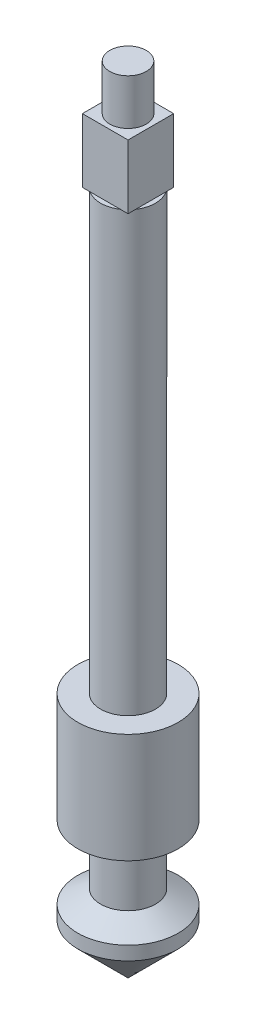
ISO-10303-21;
HEADER;
FILE_DESCRIPTION(('STEP AP214'),'2;1');
FILE_NAME('part.step','',(''),(''),'','','');
FILE_SCHEMA(('AUTOMOTIVE_DESIGN { 1 0 10303 214 1 1 1 1 }'));
ENDSEC;
DATA;
#1=APPLICATION_CONTEXT('core data for automotive mechanical design processes');
#2=APPLICATION_PROTOCOL_DEFINITION('international standard','automotive_design',2000,#1);
#3=PRODUCT_CONTEXT('',#1,'mechanical');
#4=PRODUCT('Part','Part','',(#3));
#5=PRODUCT_RELATED_PRODUCT_CATEGORY('part','',(#4));
#6=PRODUCT_DEFINITION_FORMATION('','',#4);
#7=PRODUCT_DEFINITION_CONTEXT('part definition',#1,'design');
#8=PRODUCT_DEFINITION('design','',#6,#7);
#9=PRODUCT_DEFINITION_SHAPE('','',#8);
#10=(LENGTH_UNIT() NAMED_UNIT(*) SI_UNIT(.MILLI.,.METRE.));
#11=(NAMED_UNIT(*) PLANE_ANGLE_UNIT() SI_UNIT($,.RADIAN.));
#12=(NAMED_UNIT(*) SI_UNIT($,.STERADIAN.) SOLID_ANGLE_UNIT());
#13=UNCERTAINTY_MEASURE_WITH_UNIT(LENGTH_MEASURE(1.E-05),#10,'distance_accuracy_value','');
#14=(GEOMETRIC_REPRESENTATION_CONTEXT(3) GLOBAL_UNCERTAINTY_ASSIGNED_CONTEXT((#13)) GLOBAL_UNIT_ASSIGNED_CONTEXT((#10,
#11,#12)) REPRESENTATION_CONTEXT('',''));
#15=CARTESIAN_POINT('',(0.,0.,0.));
#16=DIRECTION('',(0.,0.,1.));
#17=DIRECTION('',(1.,0.,0.));
#18=AXIS2_PLACEMENT_3D('',#15,#16,#17);
#19=CARTESIAN_POINT('',(0.,11.0000000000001,0.));
#20=DIRECTION('',(0.,1.,0.));
#21=DIRECTION('',(0.,0.,1.));
#22=AXIS2_PLACEMENT_3D('',#19,#20,#21);
#23=CONICAL_SURFACE('',#22,11.0000000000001,0.785398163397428);
#24=CARTESIAN_POINT('',(0.,0.,0.));
#25=VERTEX_POINT('',#24);
#26=VERTEX_LOOP('',#25);
#27=FACE_BOUND('',#26,.T.);
#28=CARTESIAN_POINT('',(0.,11.,0.));
#29=DIRECTION('',(0.,-1.,0.));
#30=DIRECTION('',(0.,0.,-1.));
#31=AXIS2_PLACEMENT_3D('',#28,#29,#30);
#32=CIRCLE('',#31,11.);
#33=CARTESIAN_POINT('',(0.,11.,-11.));
#34=VERTEX_POINT('',#33);
#35=EDGE_CURVE('E136',#34,#34,#32,.F.);
#36=ORIENTED_EDGE('',*,*,#35,.F.);
#37=EDGE_LOOP('',(#36));
#38=FACE_BOUND('',#37,.T.);
#39=ADVANCED_FACE('F16',(#27,#38),#23,.T.);
#40=CARTESIAN_POINT('',(0.,0.,0.));
#41=DIRECTION('',(0.,-1.,0.));
#42=DIRECTION('',(0.,0.,-1.));
#43=AXIS2_PLACEMENT_3D('',#40,#41,#42);
#44=CYLINDRICAL_SURFACE('',#43,11.);
#45=CARTESIAN_POINT('',(0.,14.,0.));
#46=DIRECTION('',(0.,-1.,0.));
#47=DIRECTION('',(0.,0.,-1.));
#48=AXIS2_PLACEMENT_3D('',#45,#46,#47);
#49=CIRCLE('',#48,11.);
#50=CARTESIAN_POINT('',(0.,14.,-11.));
#51=VERTEX_POINT('',#50);
#52=EDGE_CURVE('E133',#51,#51,#49,.F.);
#53=ORIENTED_EDGE('',*,*,#52,.F.);
#54=EDGE_LOOP('',(#53));
#55=FACE_BOUND('',#54,.T.);
#56=ORIENTED_EDGE('',*,*,#35,.T.);
#57=EDGE_LOOP('',(#56));
#58=FACE_BOUND('',#57,.T.);
#59=ADVANCED_FACE('F192',(#55,#58),#44,.T.);
#60=CARTESIAN_POINT('',(0.,14.,0.));
#61=DIRECTION('',(0.,-1.,0.));
#62=DIRECTION('',(1.,0.,0.));
#63=AXIS2_PLACEMENT_3D('',#60,#61,#62);
#64=CONICAL_SURFACE('',#63,11.,1.03037682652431);
#65=CARTESIAN_POINT('',(0.,17.,0.));
#66=DIRECTION('',(0.,-1.,0.));
#67=DIRECTION('',(0.,0.,-1.));
#68=AXIS2_PLACEMENT_3D('',#65,#66,#67);
#69=CIRCLE('',#68,6.);
#70=CARTESIAN_POINT('',(0.,17.,-6.));
#71=VERTEX_POINT('',#70);
#72=EDGE_CURVE('E130',#71,#71,#69,.F.);
#73=ORIENTED_EDGE('',*,*,#72,.F.);
#74=EDGE_LOOP('',(#73));
#75=FACE_BOUND('',#74,.T.);
#76=ORIENTED_EDGE('',*,*,#52,.T.);
#77=EDGE_LOOP('',(#76));
#78=FACE_BOUND('',#77,.T.);
#79=ADVANCED_FACE('F183',(#75,#78),#64,.T.);
#80=CARTESIAN_POINT('',(0.,174.,0.));
#81=DIRECTION('',(0.,1.,0.));
#82=DIRECTION('',(0.,0.,1.));
#83=AXIS2_PLACEMENT_3D('',#80,#81,#82);
#84=PLANE('',#83);
#85=CARTESIAN_POINT('',(0.,174.,0.));
#86=DIRECTION('',(0.,-1.,0.));
#87=DIRECTION('',(0.,0.,-1.));
#88=AXIS2_PLACEMENT_3D('',#85,#86,#87);
#89=CIRCLE('',#88,4.);
#90=CARTESIAN_POINT('',(0.,174.,-4.));
#91=VERTEX_POINT('',#90);
#92=EDGE_CURVE('E19',#91,#91,#89,.T.);
#93=ORIENTED_EDGE('',*,*,#92,.F.);
#94=EDGE_LOOP('',(#93));
#95=FACE_BOUND('',#94,.T.);
#96=ADVANCED_FACE('F180',(#95),#84,.T.);
#97=CARTESIAN_POINT('',(0.,0.,0.));
#98=DIRECTION('',(0.,-1.,0.));
#99=DIRECTION('',(0.,0.,-1.));
#100=AXIS2_PLACEMENT_3D('',#97,#98,#99);
#101=CYLINDRICAL_SURFACE('',#100,6.);
#102=CARTESIAN_POINT('',(0.,30.,0.));
#103=DIRECTION('',(0.,-1.,0.));
#104=DIRECTION('',(0.,0.,-1.));
#105=AXIS2_PLACEMENT_3D('',#102,#103,#104);
#106=CIRCLE('',#105,6.);
#107=CARTESIAN_POINT('',(0.,30.,-6.));
#108=VERTEX_POINT('',#107);
#109=EDGE_CURVE('E171',#108,#108,#106,.F.);
#110=ORIENTED_EDGE('',*,*,#109,.F.);
#111=EDGE_LOOP('',(#110));
#112=FACE_BOUND('',#111,.T.);
#113=ORIENTED_EDGE('',*,*,#72,.T.);
#114=EDGE_LOOP('',(#113));
#115=FACE_BOUND('',#114,.T.);
#116=ADVANCED_FACE('F182',(#112,#115),#101,.T.);
#117=CARTESIAN_POINT('',(0.,174.,0.));
#118=DIRECTION('',(0.,-1.,0.));
#119=DIRECTION('',(0.,0.,-1.));
#120=AXIS2_PLACEMENT_3D('',#117,#118,#119);
#121=CYLINDRICAL_SURFACE('',#120,4.);
#122=CARTESIAN_POINT('',(0.,164.,0.));
#123=DIRECTION('',(0.,-1.,0.));
#124=DIRECTION('',(0.,0.,-1.));
#125=AXIS2_PLACEMENT_3D('',#122,#123,#124);
#126=CIRCLE('',#125,4.);
#127=CARTESIAN_POINT('',(0.,164.,-4.));
#128=VERTEX_POINT('',#127);
#129=EDGE_CURVE('E100',#128,#128,#126,.T.);
#130=ORIENTED_EDGE('',*,*,#129,.F.);
#131=EDGE_LOOP('',(#130));
#132=FACE_BOUND('',#131,.T.);
#133=ORIENTED_EDGE('',*,*,#92,.T.);
#134=EDGE_LOOP('',(#133));
#135=FACE_BOUND('',#134,.T.);
#136=ADVANCED_FACE('F178',(#132,#135),#121,.T.);
#137=CARTESIAN_POINT('',(6.,30.,0.));
#138=DIRECTION('',(0.,-1.,0.));
#139=DIRECTION('',(0.,0.,-1.));
#140=AXIS2_PLACEMENT_3D('',#137,#138,#139);
#141=PLANE('',#140);
#142=ORIENTED_EDGE('',*,*,#109,.T.);
#143=EDGE_LOOP('',(#142));
#144=FACE_BOUND('',#143,.T.);
#145=CARTESIAN_POINT('',(0.,30.,0.));
#146=DIRECTION('',(0.,-1.,0.));
#147=DIRECTION('',(0.,0.,-1.));
#148=AXIS2_PLACEMENT_3D('',#145,#146,#147);
#149=CIRCLE('',#148,11.);
#150=CARTESIAN_POINT('',(0.,30.,-11.));
#151=VERTEX_POINT('',#150);
#152=EDGE_CURVE('E165',#151,#151,#149,.F.);
#153=ORIENTED_EDGE('',*,*,#152,.F.);
#154=EDGE_LOOP('',(#153));
#155=FACE_BOUND('',#154,.T.);
#156=ADVANCED_FACE('F255',(#144,#155),#141,.T.);
#157=CARTESIAN_POINT('',(-5.,164.,-5.));
#158=DIRECTION('',(1.,0.,0.));
#159=DIRECTION('',(0.,0.,-1.));
#160=AXIS2_PLACEMENT_3D('',#157,#158,#159);
#161=PLANE('',#160);
#162=DIRECTION('',(0.,0.,1.));
#163=VECTOR('',#162,1.);
#164=CARTESIAN_POINT('',(-5.,150.,0.));
#165=LINE('',#164,#163);
#166=CARTESIAN_POINT('',(-5.,150.,3.31662479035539));
#167=VERTEX_POINT('',#166);
#168=CARTESIAN_POINT('',(-5.,150.,-3.3166247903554));
#169=VERTEX_POINT('',#168);
#170=EDGE_CURVE('E58',#167,#169,#165,.F.);
#171=ORIENTED_EDGE('',*,*,#170,.F.);
#172=DIRECTION('',(0.,0.,1.));
#173=VECTOR('',#172,1.);
#174=CARTESIAN_POINT('',(-5.,150.,0.));
#175=LINE('',#174,#173);
#176=CARTESIAN_POINT('',(-5.,150.,5.));
#177=VERTEX_POINT('',#176);
#178=EDGE_CURVE('E168',#167,#177,#175,.T.);
#179=ORIENTED_EDGE('',*,*,#178,.T.);
#180=DIRECTION('',(0.,1.,0.));
#181=VECTOR('',#180,1.);
#182=CARTESIAN_POINT('',(-5.,164.,5.));
#183=LINE('',#182,#181);
#184=CARTESIAN_POINT('',(-5.,164.,5.));
#185=VERTEX_POINT('',#184);
#186=EDGE_CURVE('E98',#177,#185,#183,.T.);
#187=ORIENTED_EDGE('',*,*,#186,.T.);
#188=DIRECTION('',(0.,0.,1.));
#189=VECTOR('',#188,1.);
#190=CARTESIAN_POINT('',(-5.,164.,0.));
#191=LINE('',#190,#189);
#192=CARTESIAN_POINT('',(-5.,164.,-5.));
#193=VERTEX_POINT('',#192);
#194=EDGE_CURVE('E92',#193,#185,#191,.T.);
#195=ORIENTED_EDGE('',*,*,#194,.F.);
#196=DIRECTION('',(0.,1.,0.));
#197=VECTOR('',#196,1.);
#198=CARTESIAN_POINT('',(-5.,164.,-5.));
#199=LINE('',#198,#197);
#200=CARTESIAN_POINT('',(-5.,150.,-5.));
#201=VERTEX_POINT('',#200);
#202=EDGE_CURVE('E95',#193,#201,#199,.F.);
#203=ORIENTED_EDGE('',*,*,#202,.T.);
#204=DIRECTION('',(0.,0.,1.));
#205=VECTOR('',#204,1.);
#206=CARTESIAN_POINT('',(-5.,150.,0.));
#207=LINE('',#206,#205);
#208=EDGE_CURVE('E108',#201,#169,#207,.T.);
#209=ORIENTED_EDGE('',*,*,#208,.T.);
#210=EDGE_LOOP('',(#171,#179,#187,#195,#203,#209));
#211=FACE_BOUND('',#210,.T.);
#212=ADVANCED_FACE('F93',(#211),#161,.F.);
#213=CARTESIAN_POINT('',(0.,164.,0.));
#214=DIRECTION('',(0.,1.,0.));
#215=DIRECTION('',(0.,0.,1.));
#216=AXIS2_PLACEMENT_3D('',#213,#214,#215);
#217=PLANE('',#216);
#218=ORIENTED_EDGE('',*,*,#194,.T.);
#219=DIRECTION('',(-1.,0.,0.));
#220=VECTOR('',#219,1.);
#221=CARTESIAN_POINT('',(-5.,164.,5.));
#222=LINE('',#221,#220);
#223=CARTESIAN_POINT('',(5.,164.,5.));
#224=VERTEX_POINT('',#223);
#225=EDGE_CURVE('E127',#185,#224,#222,.F.);
#226=ORIENTED_EDGE('',*,*,#225,.T.);
#227=DIRECTION('',(0.,0.,1.));
#228=VECTOR('',#227,1.);
#229=CARTESIAN_POINT('',(5.,164.,5.));
#230=LINE('',#229,#228);
#231=CARTESIAN_POINT('',(5.,164.,-5.));
#232=VERTEX_POINT('',#231);
#233=EDGE_CURVE('E74',#224,#232,#230,.F.);
#234=ORIENTED_EDGE('',*,*,#233,.T.);
#235=DIRECTION('',(1.,0.,0.));
#236=VECTOR('',#235,1.);
#237=CARTESIAN_POINT('',(5.,164.,-5.));
#238=LINE('',#237,#236);
#239=EDGE_CURVE('E102',#232,#193,#238,.F.);
#240=ORIENTED_EDGE('',*,*,#239,.T.);
#241=EDGE_LOOP('',(#218,#226,#234,#240));
#242=FACE_BOUND('',#241,.T.);
#243=ORIENTED_EDGE('',*,*,#129,.T.);
#244=EDGE_LOOP('',(#243));
#245=FACE_BOUND('',#244,.T.);
#246=ADVANCED_FACE('F103',(#242,#245),#217,.T.);
#247=CARTESIAN_POINT('',(-5.,164.,5.));
#248=DIRECTION('',(0.,0.,-1.));
#249=DIRECTION('',(-1.,0.,0.));
#250=AXIS2_PLACEMENT_3D('',#247,#248,#249);
#251=PLANE('',#250);
#252=DIRECTION('',(1.,0.,0.));
#253=VECTOR('',#252,1.);
#254=CARTESIAN_POINT('',(0.,150.,5.));
#255=LINE('',#254,#253);
#256=CARTESIAN_POINT('',(3.3166247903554,150.,5.));
#257=VERTEX_POINT('',#256);
#258=CARTESIAN_POINT('',(-3.3166247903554,150.,5.));
#259=VERTEX_POINT('',#258);
#260=EDGE_CURVE('E164',#257,#259,#255,.F.);
#261=ORIENTED_EDGE('',*,*,#260,.F.);
#262=DIRECTION('',(-1.,0.,0.));
#263=VECTOR('',#262,1.);
#264=CARTESIAN_POINT('',(-5.,150.,5.));
#265=LINE('',#264,#263);
#266=CARTESIAN_POINT('',(5.,150.,5.));
#267=VERTEX_POINT('',#266);
#268=EDGE_CURVE('E169',#267,#257,#265,.T.);
#269=ORIENTED_EDGE('',*,*,#268,.F.);
#270=DIRECTION('',(0.,1.,0.));
#271=VECTOR('',#270,1.);
#272=CARTESIAN_POINT('',(5.,164.,5.));
#273=LINE('',#272,#271);
#274=EDGE_CURVE('E470',#267,#224,#273,.T.);
#275=ORIENTED_EDGE('',*,*,#274,.T.);
#276=ORIENTED_EDGE('',*,*,#225,.F.);
#277=ORIENTED_EDGE('',*,*,#186,.F.);
#278=DIRECTION('',(1.,0.,0.));
#279=VECTOR('',#278,1.);
#280=CARTESIAN_POINT('',(0.,150.,5.));
#281=LINE('',#280,#279);
#282=EDGE_CURVE('E458',#177,#259,#281,.T.);
#283=ORIENTED_EDGE('',*,*,#282,.T.);
#284=EDGE_LOOP('',(#261,#269,#275,#276,#277,#283));
#285=FACE_BOUND('',#284,.T.);
#286=ADVANCED_FACE('F246',(#285),#251,.F.);
#287=CARTESIAN_POINT('',(0.,0.,0.));
#288=DIRECTION('',(0.,-1.,0.));
#289=DIRECTION('',(0.,0.,-1.));
#290=AXIS2_PLACEMENT_3D('',#287,#288,#289);
#291=CYLINDRICAL_SURFACE('',#290,11.);
#292=CARTESIAN_POINT('',(0.,54.,0.));
#293=DIRECTION('',(0.,-1.,0.));
#294=DIRECTION('',(0.,0.,-1.));
#295=AXIS2_PLACEMENT_3D('',#292,#293,#294);
#296=CIRCLE('',#295,11.);
#297=CARTESIAN_POINT('',(0.,54.,-11.));
#298=VERTEX_POINT('',#297);
#299=EDGE_CURVE('E161',#298,#298,#296,.F.);
#300=ORIENTED_EDGE('',*,*,#299,.F.);
#301=EDGE_LOOP('',(#300));
#302=FACE_BOUND('',#301,.T.);
#303=ORIENTED_EDGE('',*,*,#152,.T.);
#304=EDGE_LOOP('',(#303));
#305=FACE_BOUND('',#304,.T.);
#306=ADVANCED_FACE('F242',(#302,#305),#291,.T.);
#307=CARTESIAN_POINT('',(0.,150.,0.));
#308=DIRECTION('',(0.,1.,0.));
#309=DIRECTION('',(0.,0.,1.));
#310=AXIS2_PLACEMENT_3D('',#307,#308,#309);
#311=PLANE('',#310);
#312=ORIENTED_EDGE('',*,*,#282,.F.);
#313=ORIENTED_EDGE('',*,*,#178,.F.);
#314=CARTESIAN_POINT('',(0.,150.,0.));
#315=DIRECTION('',(0.,-1.,0.));
#316=DIRECTION('',(0.,0.,-1.));
#317=AXIS2_PLACEMENT_3D('',#314,#315,#316);
#318=CIRCLE('',#317,6.);
#319=EDGE_CURVE('E159',#259,#167,#318,.T.);
#320=ORIENTED_EDGE('',*,*,#319,.F.);
#321=EDGE_LOOP('',(#312,#313,#320));
#322=FACE_BOUND('',#321,.T.);
#323=ADVANCED_FACE('F238',(#322),#311,.F.);
#324=CARTESIAN_POINT('',(0.,150.,0.));
#325=DIRECTION('',(0.,1.,0.));
#326=DIRECTION('',(0.,0.,1.));
#327=AXIS2_PLACEMENT_3D('',#324,#325,#326);
#328=PLANE('',#327);
#329=ORIENTED_EDGE('',*,*,#170,.T.);
#330=CARTESIAN_POINT('',(0.,150.,0.));
#331=DIRECTION('',(0.,-1.,0.));
#332=DIRECTION('',(0.,0.,-1.));
#333=AXIS2_PLACEMENT_3D('',#330,#331,#332);
#334=CIRCLE('',#333,6.);
#335=EDGE_CURVE('E156',#167,#169,#334,.T.);
#336=ORIENTED_EDGE('',*,*,#335,.F.);
#337=EDGE_LOOP('',(#329,#336));
#338=FACE_BOUND('',#337,.T.);
#339=ADVANCED_FACE('F234',(#338),#328,.T.);
#340=CARTESIAN_POINT('',(0.,150.,0.));
#341=DIRECTION('',(0.,1.,0.));
#342=DIRECTION('',(0.,0.,1.));
#343=AXIS2_PLACEMENT_3D('',#340,#341,#342);
#344=PLANE('',#343);
#345=ORIENTED_EDGE('',*,*,#208,.F.);
#346=DIRECTION('',(1.,0.,0.));
#347=VECTOR('',#346,1.);
#348=CARTESIAN_POINT('',(5.,150.,-5.));
#349=LINE('',#348,#347);
#350=CARTESIAN_POINT('',(-3.3166247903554,150.,-5.));
#351=VERTEX_POINT('',#350);
#352=EDGE_CURVE('E114',#201,#351,#349,.T.);
#353=ORIENTED_EDGE('',*,*,#352,.T.);
#354=CARTESIAN_POINT('',(0.,150.,0.));
#355=DIRECTION('',(0.,-1.,0.));
#356=DIRECTION('',(0.,0.,-1.));
#357=AXIS2_PLACEMENT_3D('',#354,#355,#356);
#358=CIRCLE('',#357,6.);
#359=EDGE_CURVE('E152',#169,#351,#358,.T.);
#360=ORIENTED_EDGE('',*,*,#359,.F.);
#361=EDGE_LOOP('',(#345,#353,#360));
#362=FACE_BOUND('',#361,.T.);
#363=ADVANCED_FACE('F231',(#362),#344,.F.);
#364=CARTESIAN_POINT('',(5.,164.,-5.));
#365=DIRECTION('',(0.,0.,1.));
#366=DIRECTION('',(1.,0.,0.));
#367=AXIS2_PLACEMENT_3D('',#364,#365,#366);
#368=PLANE('',#367);
#369=DIRECTION('',(1.,0.,0.));
#370=VECTOR('',#369,1.);
#371=CARTESIAN_POINT('',(0.,150.,-5.));
#372=LINE('',#371,#370);
#373=CARTESIAN_POINT('',(3.3166247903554,150.,-5.));
#374=VERTEX_POINT('',#373);
#375=EDGE_CURVE('E155',#351,#374,#372,.T.);
#376=ORIENTED_EDGE('',*,*,#375,.F.);
#377=ORIENTED_EDGE('',*,*,#352,.F.);
#378=ORIENTED_EDGE('',*,*,#202,.F.);
#379=ORIENTED_EDGE('',*,*,#239,.F.);
#380=DIRECTION('',(0.,1.,0.));
#381=VECTOR('',#380,1.);
#382=CARTESIAN_POINT('',(5.,164.,-5.));
#383=LINE('',#382,#381);
#384=CARTESIAN_POINT('',(5.,150.,-5.));
#385=VERTEX_POINT('',#384);
#386=EDGE_CURVE('E477',#232,#385,#383,.F.);
#387=ORIENTED_EDGE('',*,*,#386,.T.);
#388=DIRECTION('',(1.,0.,0.));
#389=VECTOR('',#388,1.);
#390=CARTESIAN_POINT('',(5.,150.,-5.));
#391=LINE('',#390,#389);
#392=EDGE_CURVE('E116',#374,#385,#391,.T.);
#393=ORIENTED_EDGE('',*,*,#392,.F.);
#394=EDGE_LOOP('',(#376,#377,#378,#379,#387,#393));
#395=FACE_BOUND('',#394,.T.);
#396=ADVANCED_FACE('F112',(#395),#368,.F.);
#397=CARTESIAN_POINT('',(5.,164.,5.));
#398=DIRECTION('',(-1.,0.,0.));
#399=DIRECTION('',(0.,0.,1.));
#400=AXIS2_PLACEMENT_3D('',#397,#398,#399);
#401=PLANE('',#400);
#402=DIRECTION('',(0.,0.,1.));
#403=VECTOR('',#402,1.);
#404=CARTESIAN_POINT('',(5.,150.,0.));
#405=LINE('',#404,#403);
#406=CARTESIAN_POINT('',(5.,150.,-3.3166247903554));
#407=VERTEX_POINT('',#406);
#408=CARTESIAN_POINT('',(5.,150.,3.3166247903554));
#409=VERTEX_POINT('',#408);
#410=EDGE_CURVE('E151',#407,#409,#405,.T.);
#411=ORIENTED_EDGE('',*,*,#410,.F.);
#412=DIRECTION('',(0.,0.,1.));
#413=VECTOR('',#412,1.);
#414=CARTESIAN_POINT('',(5.,150.,0.));
#415=LINE('',#414,#413);
#416=EDGE_CURVE('E503',#407,#385,#415,.F.);
#417=ORIENTED_EDGE('',*,*,#416,.T.);
#418=ORIENTED_EDGE('',*,*,#386,.F.);
#419=ORIENTED_EDGE('',*,*,#233,.F.);
#420=ORIENTED_EDGE('',*,*,#274,.F.);
#421=DIRECTION('',(0.,0.,1.));
#422=VECTOR('',#421,1.);
#423=CARTESIAN_POINT('',(5.,150.,5.));
#424=LINE('',#423,#422);
#425=EDGE_CURVE('E34',#409,#267,#424,.T.);
#426=ORIENTED_EDGE('',*,*,#425,.F.);
#427=EDGE_LOOP('',(#411,#417,#418,#419,#420,#426));
#428=FACE_BOUND('',#427,.T.);
#429=ADVANCED_FACE('F225',(#428),#401,.F.);
#430=CARTESIAN_POINT('',(0.,150.,0.));
#431=DIRECTION('',(0.,1.,0.));
#432=DIRECTION('',(0.,0.,1.));
#433=AXIS2_PLACEMENT_3D('',#430,#431,#432);
#434=PLANE('',#433);
#435=ORIENTED_EDGE('',*,*,#260,.T.);
#436=CARTESIAN_POINT('',(0.,150.,0.));
#437=DIRECTION('',(0.,-1.,0.));
#438=DIRECTION('',(0.,0.,-1.));
#439=AXIS2_PLACEMENT_3D('',#436,#437,#438);
#440=CIRCLE('',#439,6.);
#441=EDGE_CURVE('E65',#257,#259,#440,.T.);
#442=ORIENTED_EDGE('',*,*,#441,.F.);
#443=EDGE_LOOP('',(#435,#442));
#444=FACE_BOUND('',#443,.T.);
#445=ADVANCED_FACE('F221',(#444),#434,.T.);
#446=CARTESIAN_POINT('',(11.,54.,0.));
#447=DIRECTION('',(0.,1.,0.));
#448=DIRECTION('',(0.,0.,1.));
#449=AXIS2_PLACEMENT_3D('',#446,#447,#448);
#450=PLANE('',#449);
#451=ORIENTED_EDGE('',*,*,#299,.T.);
#452=EDGE_LOOP('',(#451));
#453=FACE_BOUND('',#452,.T.);
#454=CARTESIAN_POINT('',(0.,54.,0.));
#455=DIRECTION('',(0.,-1.,0.));
#456=DIRECTION('',(0.,0.,-1.));
#457=AXIS2_PLACEMENT_3D('',#454,#455,#456);
#458=CIRCLE('',#457,6.);
#459=CARTESIAN_POINT('',(0.,54.,-6.));
#460=VERTEX_POINT('',#459);
#461=EDGE_CURVE('E147',#460,#460,#458,.F.);
#462=ORIENTED_EDGE('',*,*,#461,.F.);
#463=EDGE_LOOP('',(#462));
#464=FACE_BOUND('',#463,.T.);
#465=ADVANCED_FACE('F217',(#453,#464),#450,.T.);
#466=CARTESIAN_POINT('',(0.,150.,0.));
#467=DIRECTION('',(0.,1.,0.));
#468=DIRECTION('',(0.,0.,1.));
#469=AXIS2_PLACEMENT_3D('',#466,#467,#468);
#470=PLANE('',#469);
#471=CARTESIAN_POINT('',(0.,150.,0.));
#472=DIRECTION('',(0.,-1.,0.));
#473=DIRECTION('',(0.,0.,-1.));
#474=AXIS2_PLACEMENT_3D('',#471,#472,#473);
#475=CIRCLE('',#474,6.);
#476=EDGE_CURVE('E144',#351,#374,#475,.T.);
#477=ORIENTED_EDGE('',*,*,#476,.F.);
#478=ORIENTED_EDGE('',*,*,#375,.T.);
#479=EDGE_LOOP('',(#477,#478));
#480=FACE_BOUND('',#479,.T.);
#481=ADVANCED_FACE('F213',(#480),#470,.T.);
#482=CARTESIAN_POINT('',(0.,150.,0.));
#483=DIRECTION('',(0.,1.,0.));
#484=DIRECTION('',(0.,0.,1.));
#485=AXIS2_PLACEMENT_3D('',#482,#483,#484);
#486=PLANE('',#485);
#487=ORIENTED_EDGE('',*,*,#392,.T.);
#488=ORIENTED_EDGE('',*,*,#416,.F.);
#489=CARTESIAN_POINT('',(0.,150.,0.));
#490=DIRECTION('',(0.,-1.,0.));
#491=DIRECTION('',(0.,0.,-1.));
#492=AXIS2_PLACEMENT_3D('',#489,#490,#491);
#493=CIRCLE('',#492,6.);
#494=EDGE_CURVE('E141',#374,#407,#493,.T.);
#495=ORIENTED_EDGE('',*,*,#494,.F.);
#496=EDGE_LOOP('',(#487,#488,#495));
#497=FACE_BOUND('',#496,.T.);
#498=ADVANCED_FACE('F209',(#497),#486,.F.);
#499=CARTESIAN_POINT('',(0.,150.,0.));
#500=DIRECTION('',(0.,1.,0.));
#501=DIRECTION('',(0.,0.,1.));
#502=AXIS2_PLACEMENT_3D('',#499,#500,#501);
#503=PLANE('',#502);
#504=ORIENTED_EDGE('',*,*,#410,.T.);
#505=CARTESIAN_POINT('',(0.,150.,0.));
#506=DIRECTION('',(0.,-1.,0.));
#507=DIRECTION('',(0.,0.,-1.));
#508=AXIS2_PLACEMENT_3D('',#505,#506,#507);
#509=CIRCLE('',#508,6.);
#510=EDGE_CURVE('E25',#407,#409,#509,.T.);
#511=ORIENTED_EDGE('',*,*,#510,.F.);
#512=EDGE_LOOP('',(#504,#511));
#513=FACE_BOUND('',#512,.T.);
#514=ADVANCED_FACE('F203',(#513),#503,.T.);
#515=CARTESIAN_POINT('',(0.,150.,0.));
#516=DIRECTION('',(0.,1.,0.));
#517=DIRECTION('',(0.,0.,1.));
#518=AXIS2_PLACEMENT_3D('',#515,#516,#517);
#519=PLANE('',#518);
#520=ORIENTED_EDGE('',*,*,#425,.T.);
#521=ORIENTED_EDGE('',*,*,#268,.T.);
#522=CARTESIAN_POINT('',(0.,150.,0.));
#523=DIRECTION('',(0.,-1.,0.));
#524=DIRECTION('',(0.,0.,-1.));
#525=AXIS2_PLACEMENT_3D('',#522,#523,#524);
#526=CIRCLE('',#525,6.);
#527=EDGE_CURVE('E11',#409,#257,#526,.T.);
#528=ORIENTED_EDGE('',*,*,#527,.F.);
#529=EDGE_LOOP('',(#520,#521,#528));
#530=FACE_BOUND('',#529,.T.);
#531=ADVANCED_FACE('F197',(#530),#519,.F.);
#532=CARTESIAN_POINT('',(0.,0.,0.));
#533=DIRECTION('',(0.,-1.,0.));
#534=DIRECTION('',(0.,0.,-1.));
#535=AXIS2_PLACEMENT_3D('',#532,#533,#534);
#536=CYLINDRICAL_SURFACE('',#535,6.);
#537=ORIENTED_EDGE('',*,*,#461,.T.);
#538=EDGE_LOOP('',(#537));
#539=FACE_BOUND('',#538,.T.);
#540=ORIENTED_EDGE('',*,*,#510,.T.);
#541=ORIENTED_EDGE('',*,*,#527,.T.);
#542=ORIENTED_EDGE('',*,*,#441,.T.);
#543=ORIENTED_EDGE('',*,*,#319,.T.);
#544=ORIENTED_EDGE('',*,*,#335,.T.);
#545=ORIENTED_EDGE('',*,*,#359,.T.);
#546=ORIENTED_EDGE('',*,*,#476,.T.);
#547=ORIENTED_EDGE('',*,*,#494,.T.);
#548=EDGE_LOOP('',(#540,#541,#542,#543,#544,#545,#546,#547));
#549=FACE_BOUND('',#548,.T.);
#550=ADVANCED_FACE('F195',(#539,#549),#536,.T.);
#551=CLOSED_SHELL('',(#39,#59,#79,#96,#116,#136,#156,#212,#246,#286,#306,#323,#339,#363,#396,
#429,#445,#465,#481,#498,#514,#531,#550));
#552=MANIFOLD_SOLID_BREP('B1',#551);
#553=ADVANCED_BREP_SHAPE_REPRESENTATION('',(#18,#552),#14);
#554=SHAPE_DEFINITION_REPRESENTATION(#9,#553);
ENDSEC;
END-ISO-10303-21;
